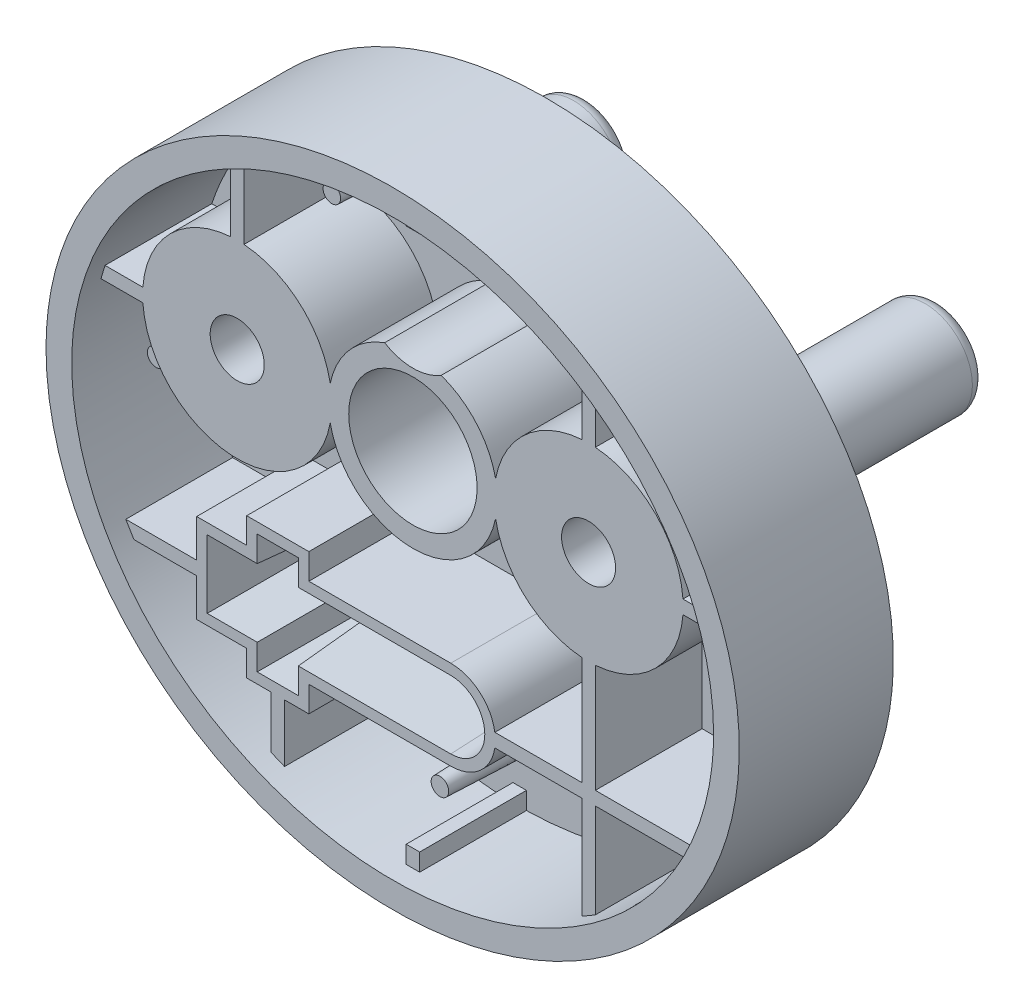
from build123d import *

# Parameters (mm, degrees)
ESQUISSE1_RX                         = 25.65
ESQUISSE1_RY                         = 23.15
CORPS1_DEPTH                         = 11.4
ESQUISSE2_RX                         = 25.65
ESQUISSE2_RY                         = 23.15
CORPS2_DEPTH                         = 2
ESQUISSE3_R                          = 0.790475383
ASSEMBLAGE_COUVERCLE_DEPTH           = 1.9
ASSEMBLAGE_COUVERCLE_TAPER           = -2
ASSEMBLAGE_COUVERCLE_OTHER_WAY_DEPTH = 4
ASSEMBLAGE_COUVERCLE_OTHER_WAY_TAPER = 2
PASSAGE_OUTIL_DEPTH                  = 7.9
ESQUISSE14_R                         = 6
ESQUISSE14_R_2                       = 3.5
ENL_V_MAT_EXTRU_6_DEPTH              = 3
CONG_1_R                             = 1
ENL_V_START                          = -3
ESQUISSE15_R                         = 2
ENL_V_MAT_EXTRU_7_DEPTH              = 3
CONG_1_OF_SYM_TRIE_MIP_BOITIER_R     = 1
ESQUISSE7_R                          = 6.25
ESQUISSE7_R_2                        = 4.75
PASSAGE_BUTEE_DEPTH                  = 7.9
ESQUISSE9_R                          = 4.75
ENL_V_MAT_EXTRU_3_DEPTH              = 39.95953041
ESQUISSE10_R                         = 3.25
PASSAGE_CENTRE_RESSORT_DEPTH         = 39.95953041
ESQUISSE11_R                         = 4
ENL_V_MAT_EXTRU_5_DEPTH              = 17
EXTRUSION3_DEPTH                     = 4.5
ENL_V_MAT_EXTRU_8_DEPTH              = 39.076830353
ENL_V_MAT_EXTRU_8_TAPER              = -3
EXTRU_MINCE1_REACH                   = 45.182
ESQUISSE18_W                         = 6.306238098
ESQUISSE18_H                         = 1
EXTRU_MINCE2_REACH                   = 45.182
ESQUISSE19_W                         = 16.439949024
ESQUISSE19_H                         = 1
EXTRU_MINCE3_REACH                   = 45.182
ESQUISSE20_W                         = 4.350021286
ESQUISSE20_H                         = 1
EXTRU_MINCE4_REACH                   = 45.182
ESQUISSE21_W                         = 3.832703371
ESQUISSE21_H                         = 1
EXTRU_MINCE5_START                   = -7.9
ESQUISSE22_W                         = 1
ESQUISSE22_H                         = 17.247221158
EXTRU_MINCE5_DEPTH                   = 7.9
EXTRU_MINCE6_REACH                   = 45.182
ESQUISSE23_W                         = 1
ESQUISSE23_H                         = 6.428657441
EXTRU_MINCE7_REACH                   = 45.182
ESQUISSE24_W                         = 1
ESQUISSE24_H                         = 6.472408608
EXTRU_MINCE8_REACH                   = 45.182
ESQUISSE25_W                         = 1
ESQUISSE25_H                         = 4.427779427
BOSS_EXTRU_1_REACH                   = 45.182
ESQUISSE26_W                         = 1
ESQUISSE26_H                         = 2.046274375
ESQUISSE26_H_2                       = 1.568299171


with BuildPart() as part:
    # Esquisse1 → corps1 (new body)
    with BuildSketch(Plane.XY):
        with Locations(Location((0, 0), (0, 0, 180))):
            Ellipse(ESQUISSE1_RX, ESQUISSE1_RY)
        with BuildLine():
            add(Edge.make_bspline(
                [(23.75, 0), (23.75, 2.781618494), (23.13185107, 5.562142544), (20.752426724, 10.701903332), (18.992087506, 13.0591178), (14.5954846, 16.9929204), (11.960950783, 18.567960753), (6.216512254, 20.696919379), (3.108867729, 21.25), (-3.108867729, 21.25), (-6.216512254, 20.696919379), (-11.960950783, 18.567960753), (-14.5954846, 16.9929204), (-18.992087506, 13.0591178), (-20.752426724, 10.701903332), (-23.13185107, 5.562142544), (-23.75, 2.781618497), (-23.75, 0), (-23.75, -2.781618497), (-23.13185107, -5.562142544), (-20.752426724, -10.701903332), (-18.992087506, -13.0591178), (-14.5954846, -16.9929204), (-11.960950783, -18.567960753), (-6.216512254, -20.696919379), (-3.108867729, -21.25), (3.108867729, -21.25), (6.216512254, -20.696919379), (11.960950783, -18.567960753), (14.5954846, -16.9929204), (18.992087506, -13.0591178), (20.752426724, -10.701903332), (23.13185107, -5.562142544), (23.75, -2.781618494), (23.75, 0)],
                knots=[3.141592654, 3.141592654, 3.141592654, 3.141592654, 3.534291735, 3.534291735, 3.926990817, 3.926990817, 4.319689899, 4.319689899, 4.71238898, 4.71238898, 5.105088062, 5.105088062, 5.497787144, 5.497787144, 5.890486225, 5.890486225, 6.283185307, 6.283185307, 6.283185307, 6.675884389, 6.675884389, 7.068583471, 7.068583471, 7.461282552, 7.461282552, 7.853981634, 7.853981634, 8.246680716, 8.246680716, 8.639379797, 8.639379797, 9.032078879, 9.032078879, 9.424777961, 9.424777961, 9.424777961, 9.424777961], degree=3))
        make_face(mode=Mode.SUBTRACT)
    extrude(amount=-CORPS1_DEPTH)

    # Esquisse2 → corps2 (add)
    with BuildSketch(Plane(origin=(0, 0, -11.4), x_dir=(-1, 0, 0), z_dir=(0, 0, -1))):
        with Locations((0, 0)):
            Ellipse(ESQUISSE2_RX, ESQUISSE2_RY)
    extrude(amount=-CORPS2_DEPTH)

    # Esquisse3 → assemblage couvercle (add)
    with BuildSketch(Plane(origin=(0, 0, -7.5), x_dir=(-1, 0, 0), z_dir=(0, 0, -1))):
        with Locations((21, 0)):
            Circle(ESQUISSE3_R)
        with Locations((8, 17)):
            Circle(ESQUISSE3_R)
        with Locations((0, -17)):
            Circle(ESQUISSE3_R)
        with Locations((-8, 17)):
            Circle(ESQUISSE3_R)
        with Locations((-21, 0)):
            Circle(ESQUISSE3_R)
    extrude(amount=ASSEMBLAGE_COUVERCLE_DEPTH, taper=ASSEMBLAGE_COUVERCLE_TAPER)

    # Esquisse3 → assemblage couvercle other way (add)
    with BuildSketch(Plane(origin=(0, 0, -7.5), x_dir=(-1, 0, 0), z_dir=(0, 0, -1))):
        with Locations((21, 0)):
            Circle(ESQUISSE3_R)
        with Locations((8, 17)):
            Circle(ESQUISSE3_R)
        with Locations((0, -17)):
            Circle(ESQUISSE3_R)
        with Locations((-8, 17)):
            Circle(ESQUISSE3_R)
        with Locations((-21, 0)):
            Circle(ESQUISSE3_R)
    extrude(amount=-ASSEMBLAGE_COUVERCLE_OTHER_WAY_DEPTH, taper=ASSEMBLAGE_COUVERCLE_OTHER_WAY_TAPER)

    # Esquisse4 → passage outil (add)
    with BuildSketch(Plane(origin=(-3.179364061, 17.515032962, -9.4), x_dir=(1, 0, 0), z_dir=(0, 0, 1))):
        with BuildLine():
            Line((-12.820635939, -24.215032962), (-9.120635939, -24.215032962))
            Line((-9.120635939, -24.215032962), (-9.120635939, -22.315032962))
            Line((-9.120635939, -22.315032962), (-4.520635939, -22.315032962))
            Line((-4.520635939, -22.315032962), (-4.520635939, -24.215032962))
            Line((-4.520635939, -24.215032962), (5.979364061, -24.215032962))
            ThreePointArc((5.979364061, -24.215032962), (9.279364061, -27.515032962), (5.979364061, -30.815032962))
            Line((5.979364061, -30.815032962), (-4.520635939, -30.815032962))
            Line((-4.520635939, -30.815032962), (-4.520635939, -32.715032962))
            Line((-4.520635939, -32.715032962), (-9.120635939, -32.715032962))
            Line((-9.120635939, -32.715032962), (-9.120635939, -30.815032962))
            Line((-9.120635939, -30.815032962), (-12.820635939, -30.815032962))
            Line((-12.820635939, -30.815032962), (-12.820635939, -24.215032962))
        make_face()
    extrude(amount=PASSAGE_OUTIL_DEPTH)

    # Esquisse5 → MIP BOITIER 1 (revolve)
    with BuildSketch(Plane(origin=(0, 5.5, 0), x_dir=(-1, 0, 0), z_dir=(0, 1, 0)), mode=Mode.PRIVATE) as mip_boitier_1_sk:
        Polygon((15, -1.5), (20, -1.5), (20, -11.4), (19, -11.4), (19, -2.5), (16.5, -2.5), (16.5, -27.4), (15, -27.4), align=None)
    mip_boitier_1 = revolve(mip_boitier_1_sk.sketch.rotate(Axis((-13, 5.5, -0.087444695), (0, 0, -1)), 180), axis=Axis((-13, 5.5, -0.087444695), (0, 0, -1)))

    # Esquisse14 → Enl_v. mat.-Extru.6 (cut)
    with BuildSketch(Plane(origin=(0, 0, -11.4), x_dir=(-1, 0, 0), z_dir=(0, 0, -1))):
        with Locations(Location((13, 5.5, 0), (0, 0, 180))):
            Circle(ESQUISSE14_R)
        with Locations(Location((13, 5.5, 0), (0, 0, 180))):
            Circle(ESQUISSE14_R_2, mode=Mode.SUBTRACT)
    enl_v_mat_extru_6 = extrude(amount=-ENL_V_MAT_EXTRU_6_DEPTH, mode=Mode.SUBTRACT)

    # Cong_1
    cong_1_edges = [part.edges().sort_by_distance(p)[0] for p in [
        (-16.5, 5.5, -27.4),
    ]]
    fillet(cong_1_edges, radius=CONG_1_R)

    # Esquisse15 → Enl_v. mat.-Extru.7 (cut)
    with BuildSketch(Plane(origin=(0, 0, -11.4), x_dir=(-1, 0, 0), z_dir=(0, 0, -1)).offset(ENL_V_START)):
        with Locations(Location((13, 5.5, 0), (0, 0, 180))):
            Circle(ESQUISSE15_R)
    enl_v_mat_extru_7 = extrude(amount=ENL_V_MAT_EXTRU_7_DEPTH, mode=Mode.SUBTRACT)

    # Sym_trie MIP BOITIER: MIP BOITIER 1, Enl_v. mat.-Extru.6, Enl_v. mat.-Extru.7 across plane
    add(mip_boitier_1.mirror(Plane(origin=(0, 0, 0), x_dir=(0, 0, 1), z_dir=(1, 0, 0))))
    add(enl_v_mat_extru_6.mirror(Plane(origin=(0, 0, 0), x_dir=(0, 0, 1), z_dir=(1, 0, 0))), mode=Mode.SUBTRACT)
    add(enl_v_mat_extru_7.mirror(Plane(origin=(0, 0, 0), x_dir=(0, 0, 1), z_dir=(1, 0, 0))), mode=Mode.SUBTRACT)

    # Cong_1 of Sym_trie MIP BOITIER
    cong_1_of_sym_trie_mip_boitier_edges = [part.edges().sort_by_distance(p)[0] for p in [
        (16.5, 5.5, -27.4),
    ]]
    fillet(cong_1_of_sym_trie_mip_boitier_edges, radius=CONG_1_OF_SYM_TRIE_MIP_BOITIER_R)

    # Esquisse7 → PASSAGE BUTEE (add)
    with BuildSketch(Plane.XY.offset(-9.4)):
        with Locations((0, 5.5)):
            Circle(ESQUISSE7_R)
        with Locations(Location((0, 5.5, 0), (0, 0, 180))):
            Circle(ESQUISSE7_R_2, mode=Mode.SUBTRACT)
    extrude(amount=PASSAGE_BUTEE_DEPTH)

    # Esquisse9 → Enl_v. mat.-Extru.3 (cut, through all)
    with BuildSketch(Plane.XY.offset(-9.4)):
        with Locations(Location((0, 5.5, 0), (0, 0, 180))):
            Circle(ESQUISSE9_R)
    extrude(amount=-ENL_V_MAT_EXTRU_3_DEPTH, mode=Mode.SUBTRACT)

    # Esquisse10 → PASSAGE CENTRE RESSORT (cut, through all)
    with BuildSketch(Plane.XY.offset(-9.4)):
        with Locations((0, 14.8)):
            Circle(ESQUISSE10_R)
    extrude(amount=-PASSAGE_CENTRE_RESSORT_DEPTH, mode=Mode.SUBTRACT)

    # Esquisse11 → Enl_v. mat.-Extru.5 (cut)
    with BuildSketch(Plane.XY.offset(-9.4)):
        with Locations((0, 14.8)):
            Circle(ESQUISSE11_R)
    extrude(amount=ENL_V_MAT_EXTRU_5_DEPTH, mode=Mode.SUBTRACT)

    # Esquisse13 → Extrusion3 (add)
    with BuildSketch(Plane(origin=(0, 0, -11.4), x_dir=(-1, 0, 0), z_dir=(0, 0, -1))):
        with BuildLine():
            Line((-4.75, 14.8), (-3.75, 14.8))
            ThreePointArc((-3.75, 14.8), (0, 11.05), (3.75, 14.8))
            Line((3.75, 14.8), (4.75, 14.8))
            ThreePointArc((4.75, 14.8), (0, 10.05), (-4.75, 14.8))
        make_face()
    extrude(amount=EXTRUSION3_DEPTH)

    # Esquisse17 → Enl_v. mat.-Extru.8 (cut, through all)
    with BuildSketch(Plane(origin=(0, 0, -11.4), x_dir=(-1, 0, 0), z_dir=(0, 0, -1))):
        with BuildLine():
            Line((9, -8), (-2.8, -8))
            ThreePointArc((-2.8, -8), (-4.8, -10), (-2.8, -12))
            Line((-2.8, -12), (9, -12))
            Line((9, -12), (9, -13.9))
            Line((9, -13.9), (11, -13.9))
            Line((11, -13.9), (11, -12))
            Line((11, -12), (14.7, -12))
            Line((14.7, -12), (14.7, -8))
            Line((14.7, -8), (11, -8))
            Line((11, -8), (11, -6.1))
            Line((11, -6.1), (9, -6.1))
            Line((9, -6.1), (9, -8))
        make_face()
    extrude(amount=-ENL_V_MAT_EXTRU_8_DEPTH, taper=ENL_V_MAT_EXTRU_8_TAPER, mode=Mode.SUBTRACT)

    # Esquisse18 → Extru.-Mince1 (add, up to next)
    with BuildSketch(Plane.XY.offset(-1.5), mode=Mode.PRIVATE) as extru_mince1_sk1:
        with Locations((-19.153119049, -10)):
            Rectangle(ESQUISSE18_W, ESQUISSE18_H)
    extru_mince1_tool1 = extrude(extru_mince1_sk1.sketch, amount=-EXTRU_MINCE1_REACH, mode=Mode.PRIVATE) - part.part
    add(extru_mince1_tool1.solids().sort_by_distance((-19.153119, -10, -1.5))[0])

    # Esquisse19 → Extru.-Mince2 (add, up to next)
    with BuildSketch(Plane.XY.offset(-1.5), mode=Mode.PRIVATE) as extru_mince2_sk1:
        with Locations((13.538811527, -10)):
            Rectangle(ESQUISSE19_W, ESQUISSE19_H)
    extru_mince2_tool1 = extrude(extru_mince2_sk1.sketch, amount=-EXTRU_MINCE2_REACH, mode=Mode.PRIVATE) - part.part
    add(extru_mince2_tool1.solids().sort_by_distance((13.538812, -10, -1.5))[0])

    # Esquisse20 → Extru.-Mince3 (add, up to next)
    with BuildSketch(Plane.XY.offset(-1.5), mode=Mode.PRIVATE) as extru_mince3_sk1:
        with Locations((-21.736236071, 5.5)):
            Rectangle(ESQUISSE20_W, ESQUISSE20_H)
    extru_mince3_tool1 = extrude(extru_mince3_sk1.sketch, amount=-EXTRU_MINCE3_REACH, mode=Mode.PRIVATE) - part.part
    add(extru_mince3_tool1.solids().sort_by_distance((-21.736236, 5.5, -1.5))[0])

    # Esquisse21 → Extru.-Mince4 (add, up to next)
    with BuildSketch(Plane.XY.offset(-1.5), mode=Mode.PRIVATE) as extru_mince4_sk1:
        with Locations((21.560766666, 5.5)):
            Rectangle(ESQUISSE21_W, ESQUISSE21_H)
    extru_mince4_tool1 = extrude(extru_mince4_sk1.sketch, amount=-EXTRU_MINCE4_REACH, mode=Mode.PRIVATE) - part.part
    add(extru_mince4_tool1.solids().sort_by_distance((21.560767, 5.5, -1.5))[0])

    # Esquisse22 → Extru.-Mince5 (add)
    with BuildSketch(Plane.XY.offset(-1.5).offset(EXTRU_MINCE5_START)):
        with Locations((13, -9.763038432)):
            Rectangle(ESQUISSE22_W, ESQUISSE22_H)
    extrude(amount=EXTRU_MINCE5_DEPTH)

    # Esquisse23 → Extru.-Mince6 (add, up to next)
    with BuildSketch(Plane.XY.offset(-1.5), mode=Mode.PRIVATE) as extru_mince6_sk1:
        with Locations((13, 15.354706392)):
            Rectangle(ESQUISSE23_W, ESQUISSE23_H)
    extru_mince6_tool1 = extrude(extru_mince6_sk1.sketch, amount=-EXTRU_MINCE6_REACH, mode=Mode.PRIVATE) - part.part
    add(extru_mince6_tool1.solids().sort_by_distance((13, 15.354706, -1.5))[0])

    # Esquisse24 → Extru.-Mince7 (add, up to next)
    with BuildSketch(Plane.XY.offset(-1.5), mode=Mode.PRIVATE) as extru_mince7_sk1:
        with Locations((-13, 15.466463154)):
            Rectangle(ESQUISSE24_W, ESQUISSE24_H)
    extru_mince7_tool1 = extrude(extru_mince7_sk1.sketch, amount=-EXTRU_MINCE7_REACH, mode=Mode.PRIVATE) - part.part
    add(extru_mince7_tool1.solids().sort_by_distance((-13, 15.466463, -1.5))[0])

    # Esquisse25 → Extru.-Mince8 (add, up to next)
    with BuildSketch(Plane.XY.offset(-1.5), mode=Mode.PRIVATE) as extru_mince8_sk1:
        with Locations((-10, -17.413889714)):
            Rectangle(ESQUISSE25_W, ESQUISSE25_H)
    extru_mince8_tool1 = extrude(extru_mince8_sk1.sketch, amount=-EXTRU_MINCE8_REACH, mode=Mode.PRIVATE) - part.part
    add(extru_mince8_tool1.solids().sort_by_distance((-10, -17.41389, -1.5))[0])

    # Esquisse26 → Boss.-Extru.1 (add, up to next)
    with BuildSketch(Plane.XY.offset(-1.5), mode=Mode.PRIVATE) as boss_extru_1_sk1:
        with Locations((0, 20.688875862)):
            Rectangle(ESQUISSE26_W, ESQUISSE26_H)
    boss_extru_1_tool1 = extrude(boss_extru_1_sk1.sketch, amount=-BOSS_EXTRU_1_REACH, mode=Mode.PRIVATE) - part.part
    # Esquisse26 → Boss.-Extru.1 (add, up to next)
    with BuildSketch(Plane.XY.offset(-1.5), mode=Mode.PRIVATE) as boss_extru_1_sk2:
        with Locations((0, -20.734526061)):
            Rectangle(ESQUISSE26_W, ESQUISSE26_H_2)
    boss_extru_1_tool2 = extrude(boss_extru_1_sk2.sketch, amount=-BOSS_EXTRU_1_REACH, mode=Mode.PRIVATE) - part.part
    add(boss_extru_1_tool1.solids().sort_by_distance((0, 20.688876, -1.5))[0])
    add(boss_extru_1_tool2.solids().sort_by_distance((0, -20.734526, -1.5))[0])


solid = part.part
